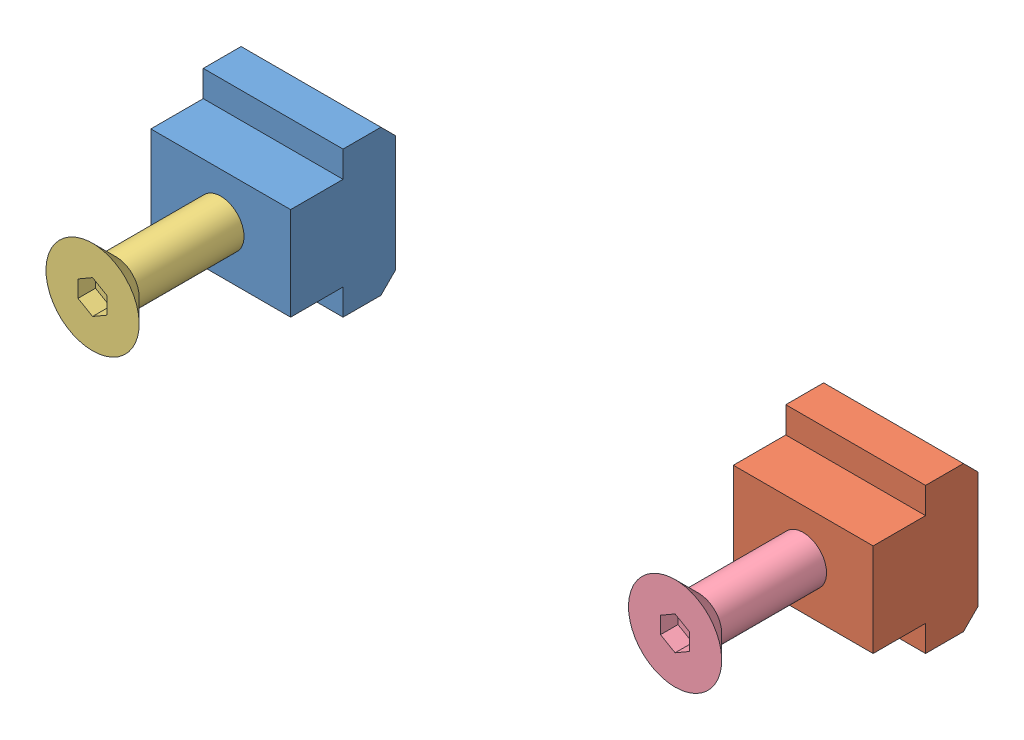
SolidWorks assembly MVAC110T16.sldasm, configuration Default (file format 15000). Lengths in mm.
Overall size (124 25 40).
4 component instances, 4 part files, 0 mates.
Components (placement in the parent):
- MVAC110T16_01-1: MVAC110T16_01.sldprt [ﾃﾞﾌｫﾙﾄ] at origin size (24 25 18)
- MVAC110T16_02-1: MVAC110T16_02.sldprt [ﾃﾞﾌｫﾙﾄ] at (100 0 0) size (24 25 18)
- MVAC110T16_03-1: MVAC110T16_03.sldprt [ﾃﾞﾌｫﾙﾄ] at (0 0 31) size (16 16 40)
- MVAC110T16_04-1: MVAC110T16_04.sldprt [ﾃﾞﾌｫﾙﾄ] at (100 0 31) size (16 16 40)
